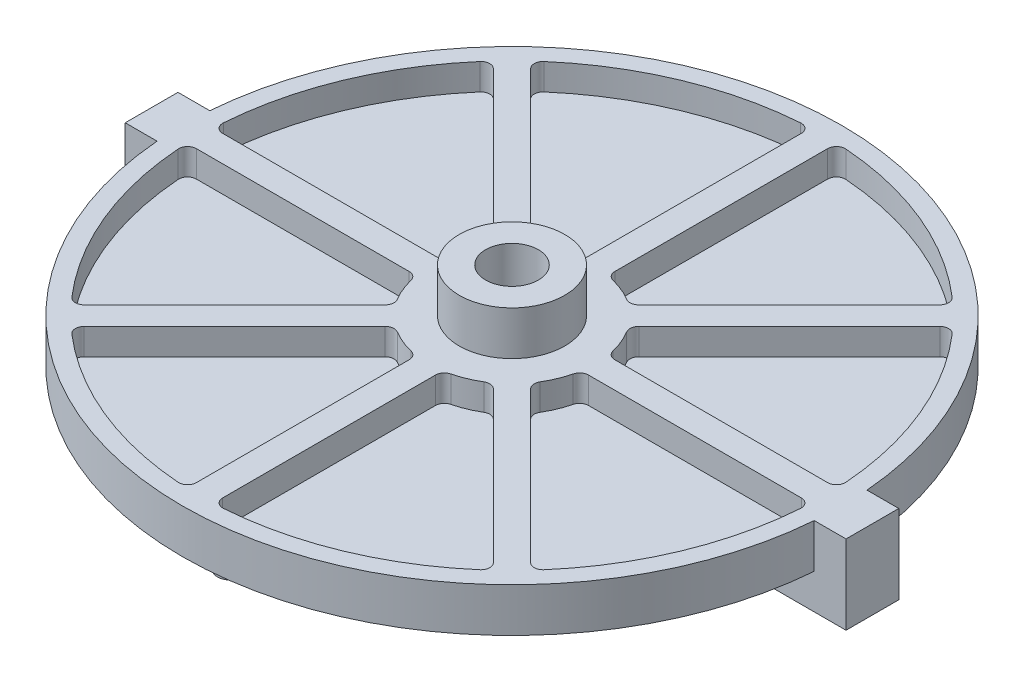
from build123d import *

# Parameters (mm, degrees)
SKETCH1_R                    = 37.5
BOSS_EXTRUDE1_DEPTH          = 5
SHELL1_T                     = -2
SKETCH2_R                    = 9.5
BOSS_EXTRUDE2_DEPTH          = 3
SKETCH3_R                    = 6
BOSS_EXTRUDE3_DEPTH          = 5
RIB1_REACH                   = 55.268
SKETCH4_WALLS_W              = 144.036378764
SKETCH4_WALLS_H              = 3
CIRPATTERN1_COUNT            = 8
BOSS_EXTRUDE4_DEPTH          = 4
SKETCH6_W                    = 82
SKETCH6_H                    = 6
BOSS_EXTRUDE5_DEPTH          = 4
BOSS_EXTRUDE6_DEPTH          = 5
BOSS_EXTRUDE7_DEPTH          = 5
F_6_0_6_DIAMETER_HOLE1_D     = 6
F_6_0_6_DIAMETER_HOLE1_DEPTH = 8
F_6_0_6_DIAMETER_HOLE1_TIP   = 1.802581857
FILLET3_R                    = 1


with BuildPart() as part:
    # Sketch1 → Boss-Extrude1 (new body)
    with BuildSketch(Plane(origin=(0, 0, 0), x_dir=(1, 0, 0), z_dir=(0, 1, 0))):
        with Locations(Location((0, 0, 0), (0, 0, 270))):
            Circle(SKETCH1_R)
    extrude(amount=BOSS_EXTRUDE1_DEPTH)

    # Shell1
    shell1_openings = [part.faces().sort_by_distance(p)[0] for p in [
        (0, 5, 0),
    ]]
    offset(amount=SHELL1_T, openings=shell1_openings, kind=Kind.INTERSECTION)

    # Sketch2 → Boss-Extrude2 (add)
    with BuildSketch(Plane(origin=(0, 2, 0), x_dir=(1, 0, 0), z_dir=(0, 1, 0))):
        with Locations(Location((0, 0, 0), (0, 0, 270))):
            Circle(SKETCH2_R)
    extrude(amount=BOSS_EXTRUDE2_DEPTH)

    # Sketch3 → Boss-Extrude3 (add)
    with BuildSketch(Plane(origin=(0, 5, 0), x_dir=(1, 0, 0), z_dir=(0, 1, 0))):
        with Locations(Location((0, 0, 0), (0, 0, 270))):
            Circle(SKETCH3_R)
    extrude(amount=BOSS_EXTRUDE3_DEPTH)

    # Sketch4 walls → Rib1 (add, up to next)
    with BuildSketch(Plane(origin=(0, 5, 0), x_dir=(1, 0, 0), z_dir=(0, 1, 0)), mode=Mode.PRIVATE) as rib1_sk1:
        with Locations((17.75, 0)):
            Rectangle(SKETCH4_WALLS_W, SKETCH4_WALLS_H)
    rib1_tool1 = extrude(rib1_sk1.sketch, amount=-RIB1_REACH, mode=Mode.PRIVATE) - part.part
    rib1 = rib1_tool1.solids().sort_by_distance((17.75, 5, 0))[0]
    add(rib1)

    # CirPattern1: Rib1 ×8 about axis
    cirpattern1_axis = Axis((0, 0, 0), (0, 1, 0))
    for i in range(1, CIRPATTERN1_COUNT):
        add(rib1.rotate(cirpattern1_axis, i * 360 / CIRPATTERN1_COUNT))

    # Sketch5 → Boss-Extrude4 (add)
    with BuildSketch(Plane.XZ):
        with BuildLine():
            Line((1.5, -17), (1.5, -32))
            ThreePointArc((1.5, -32), (0, -33.5), (-1.5, -32))
            Line((-1.5, -32), (-1.5, -17))
            ThreePointArc((-1.5, -17), (0, -15.5), (1.5, -17))
        make_face()
    boss_extrude4 = extrude(amount=BOSS_EXTRUDE4_DEPTH)

    # Mirror1: Boss-Extrude4 across plane
    add(boss_extrude4.mirror(Plane.XY))

    # Sketch6 → Boss-Extrude5 (add)
    with BuildSketch(Plane.XZ):
        Rectangle(SKETCH6_W, SKETCH6_H)
    extrude(amount=BOSS_EXTRUDE5_DEPTH)

    # Sketch7 → Boss-Extrude6 (add)
    with BuildSketch(Plane(origin=(0, 0, 0), x_dir=(1, 0, 0), z_dir=(0, 1, 0))):
        with BuildLine():
            Line((41, 3), (37.379807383, 3))
            ThreePointArc((37.379807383, 3), (37.5, 0), (37.379807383, -3))
            Line((37.379807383, -3), (41, -3))
            Line((41, -3), (41, 3))
        make_face()
    extrude(amount=BOSS_EXTRUDE6_DEPTH)

    # Sketch8 → Boss-Extrude7 (add)
    with BuildSketch(Plane(origin=(0, 0, 0), x_dir=(1, 0, 0), z_dir=(0, 1, 0))):
        with BuildLine():
            Line((-41, -3), (-37.379807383, -3))
            ThreePointArc((-37.379807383, -3), (-37.5, 0), (-37.379807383, 3))
            Line((-37.379807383, 3), (-41, 3))
            Line((-41, 3), (-41, -3))
        make_face()
    extrude(amount=BOSS_EXTRUDE7_DEPTH)

    # 6.0 _6_ Diameter Hole1
    with Locations(Plane(origin=(0, 10, 0), x_dir=(1, 0, 0), z_dir=(0, 1, 0))):
        with Locations((0, 0)):
            Hole(F_6_0_6_DIAMETER_HOLE1_D / 2, depth=F_6_0_6_DIAMETER_HOLE1_DEPTH)
            with Locations((0, 0, -(F_6_0_6_DIAMETER_HOLE1_DEPTH + F_6_0_6_DIAMETER_HOLE1_TIP / 2))):  # 118° drill point
                Cone(0, F_6_0_6_DIAMETER_HOLE1_D / 2, F_6_0_6_DIAMETER_HOLE1_TIP, mode=Mode.SUBTRACT)

    # Fillet3
    fillet3_edges = [part.edges().sort_by_distance(p)[0] for p in [
        (5.572589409, 3.5, 7.693909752),
        (7.693909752, 3.5, 5.572589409),
        (24.019212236, 3.5, 26.14053258),
        (26.14053258, 3.5, 24.019212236),
        (9.38083152, 3.5, 1.5),
        (1.5, 3.5, 9.38083152),
        (-1.5, 3.5, 35.468295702),
        (9.38083152, 3.5, -1.5),
        (1.5, 3.5, 35.468295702),
        (-1.5, 3.5, 9.38083152),
        (-5.572589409, 3.5, 7.693909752),
        (-26.14053258, 3.5, 24.019212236),
        (-24.019212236, 3.5, 26.14053258),
        (-7.693909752, 3.5, 5.572589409),
        (-9.38083152, 3.5, 1.5),
        (-35.468295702, 3.5, -1.5),
        (-35.468295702, 3.5, 1.5),
        (-9.38083152, 3.5, -1.5),
        (-7.693909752, 3.5, -5.572589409),
        (-24.019212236, 3.5, -26.14053258),
        (-26.14053258, 3.5, -24.019212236),
        (-5.572589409, 3.5, -7.693909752),
        (35.468295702, 3.5, 1.5),
        (-1.5, 3.5, -9.38083152),
        (1.5, 3.5, -35.468295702),
        (-1.5, 3.5, -35.468295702),
        (1.5, 3.5, -9.38083152),
        (35.468295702, 3.5, -1.5),
        (5.572589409, 3.5, -7.693909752),
        (26.14053258, 3.5, -24.019212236),
        (24.019212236, 3.5, -26.14053258),
        (7.693909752, 3.5, -5.572589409),
    ]]
    fillet(fillet3_edges, radius=FILLET3_R)


solid = part.part
